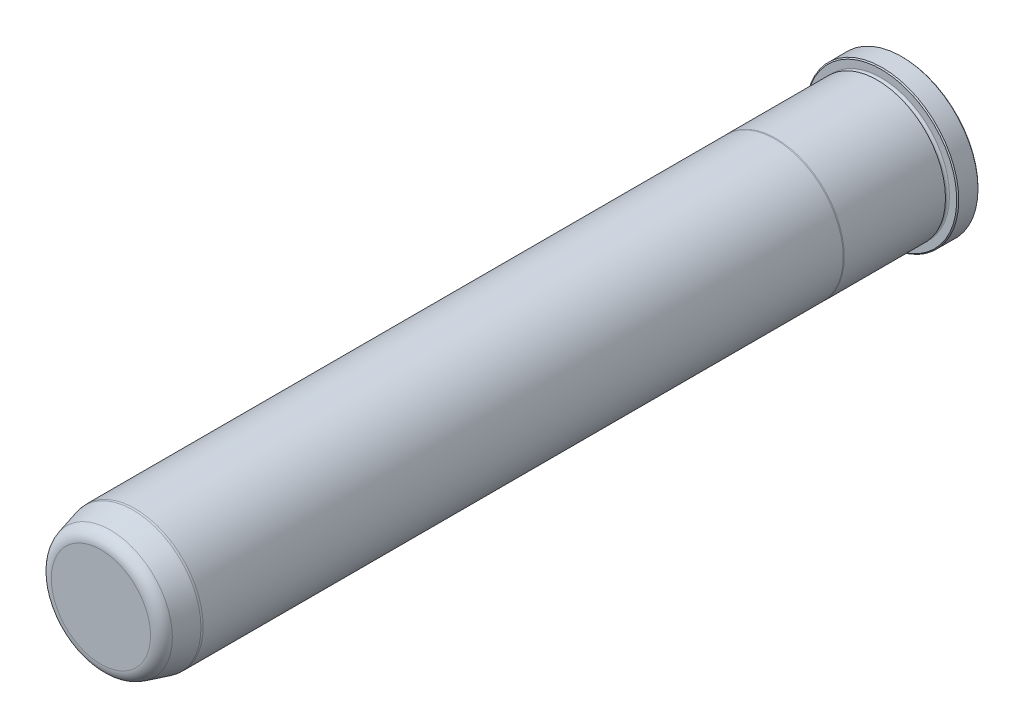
from build123d import *

# Parameters (mm, degrees)
FILLET6_R     = 4.7625
CHAMFER1_SIZE = 0.381


with BuildPart() as part:
    # Sketch1 → Revolve1 (revolve)
    with BuildSketch(Plane(origin=(0, 0, 0), x_dir=(0, 0, -1), z_dir=(1, 0, 0)), mode=Mode.PRIVATE) as revolve1_sk:
        with BuildLine():
            Line((0, 0), (0, 28.448))
            Line((0, 28.448), (-7.9248, 28.448))
            Line((-7.9248, 28.448), (-7.9248, 25.3873))
            ThreePointArc((-7.9248, 25.3873), (-8.6868, 24.6253), (-9.4488, 25.3873))
            Line((-9.4488, 25.3873), (-9.4488, 25.4127))
            Line((-9.4488, 25.4127), (-47.134763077, 25.4127))
            Line((-47.134763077, 25.4127), (-47.498, 25.3873))
            Line((-47.498, 25.3873), (-285.75, 25.3873))
            Line((-285.75, 25.3873), (-286.512, 25.320633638))
            Line((-286.512, 25.320633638), (-298.45, 22.121856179))
            Line((-298.45, 22.121856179), (-298.45, 0))
            Line((-298.45, 0), (0, 0))
        make_face()
    revolve(revolve1_sk.sketch.rotate(Axis((0, 0, 0), (0, 0, -1)), 90), axis=Axis((0, 0, 0), (0, 0, -1)))

    # Fillet6
    fillet6_edges = [part.edges().sort_by_distance(p)[0] for p in [
        (-22.121856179, 0, 298.45),
    ]]
    fillet(fillet6_edges, radius=FILLET6_R)

    # Chamfer1
    chamfer1_edges = [part.edges().sort_by_distance(p)[0] for p in [
        (-28.448, 0, 7.9248),
        (-28.448, 0, 0),
    ]]
    chamfer(chamfer1_edges, length=CHAMFER1_SIZE)


solid = part.part
